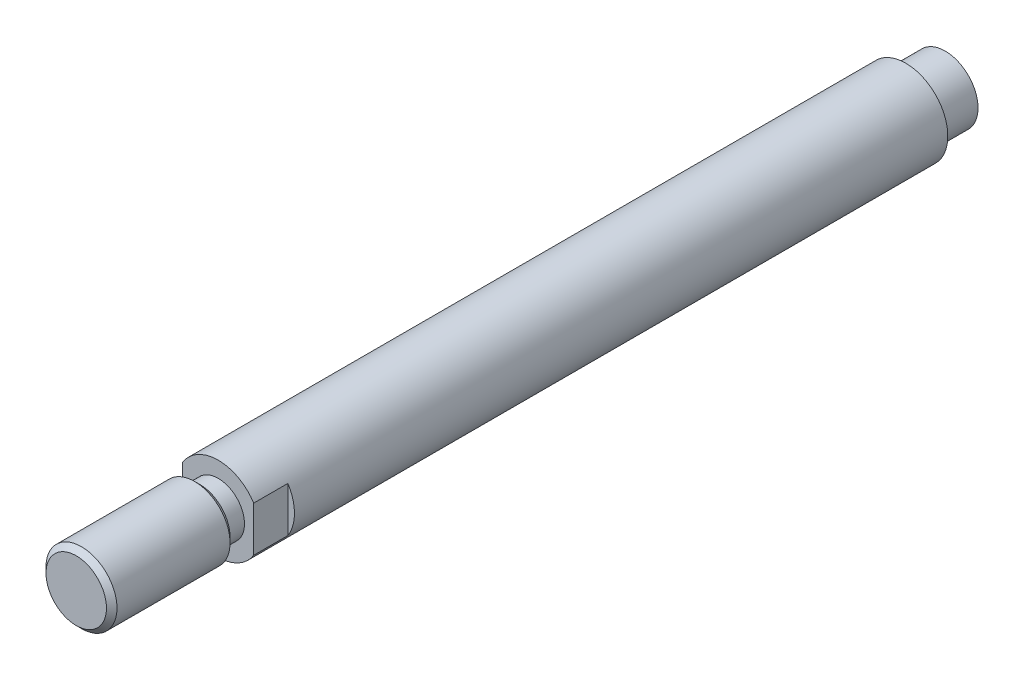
ISO-10303-21;
HEADER;
FILE_DESCRIPTION(('STEP AP214'),'2;1');
FILE_NAME('part.step','',(''),(''),'','','');
FILE_SCHEMA(('AUTOMOTIVE_DESIGN { 1 0 10303 214 1 1 1 1 }'));
ENDSEC;
DATA;
#1=APPLICATION_CONTEXT('core data for automotive mechanical design processes');
#2=APPLICATION_PROTOCOL_DEFINITION('international standard','automotive_design',2000,#1);
#3=PRODUCT_CONTEXT('',#1,'mechanical');
#4=PRODUCT('Part','Part','',(#3));
#5=PRODUCT_RELATED_PRODUCT_CATEGORY('part','',(#4));
#6=PRODUCT_DEFINITION_FORMATION('','',#4);
#7=PRODUCT_DEFINITION_CONTEXT('part definition',#1,'design');
#8=PRODUCT_DEFINITION('design','',#6,#7);
#9=PRODUCT_DEFINITION_SHAPE('','',#8);
#10=(LENGTH_UNIT() NAMED_UNIT(*) SI_UNIT(.MILLI.,.METRE.));
#11=(NAMED_UNIT(*) PLANE_ANGLE_UNIT() SI_UNIT($,.RADIAN.));
#12=(NAMED_UNIT(*) SI_UNIT($,.STERADIAN.) SOLID_ANGLE_UNIT());
#13=UNCERTAINTY_MEASURE_WITH_UNIT(LENGTH_MEASURE(1.E-05),#10,'distance_accuracy_value','');
#14=(GEOMETRIC_REPRESENTATION_CONTEXT(3) GLOBAL_UNCERTAINTY_ASSIGNED_CONTEXT((#13)) GLOBAL_UNIT_ASSIGNED_CONTEXT((#10,
#11,#12)) REPRESENTATION_CONTEXT('',''));
#15=CARTESIAN_POINT('',(0.,0.,0.));
#16=DIRECTION('',(0.,0.,1.));
#17=DIRECTION('',(1.,0.,0.));
#18=AXIS2_PLACEMENT_3D('',#15,#16,#17);
#19=CARTESIAN_POINT('',(0.,0.,0.));
#20=DIRECTION('',(0.,0.,-1.));
#21=DIRECTION('',(-1.,0.,0.));
#22=AXIS2_PLACEMENT_3D('',#19,#20,#21);
#23=PLANE('',#22);
#24=CARTESIAN_POINT('',(0.,0.,0.));
#25=DIRECTION('',(0.,0.,-1.));
#26=DIRECTION('',(-1.,0.,0.));
#27=AXIS2_PLACEMENT_3D('',#24,#25,#26);
#28=CIRCLE('',#27,12.5);
#29=CARTESIAN_POINT('',(-12.5,0.,0.));
#30=VERTEX_POINT('',#29);
#31=EDGE_CURVE('E409',#30,#30,#28,.T.);
#32=ORIENTED_EDGE('',*,*,#31,.T.);
#33=EDGE_LOOP('',(#32));
#34=FACE_BOUND('',#33,.T.);
#35=ADVANCED_FACE('F348',(#34),#23,.T.);
#36=CARTESIAN_POINT('',(0.,0.,330.5));
#37=DIRECTION('',(0.,0.,1.));
#38=DIRECTION('',(1.,0.,0.));
#39=AXIS2_PLACEMENT_3D('',#36,#37,#38);
#40=PLANE('',#39);
#41=CARTESIAN_POINT('',(0.,0.,330.5));
#42=DIRECTION('',(0.,0.,1.));
#43=DIRECTION('',(1.,0.,0.));
#44=AXIS2_PLACEMENT_3D('',#41,#42,#43);
#45=CIRCLE('',#44,11.5);
#46=CARTESIAN_POINT('',(11.5,0.,330.5));
#47=VERTEX_POINT('',#46);
#48=EDGE_CURVE('E437',#47,#47,#45,.T.);
#49=ORIENTED_EDGE('',*,*,#48,.T.);
#50=EDGE_LOOP('',(#49));
#51=FACE_BOUND('',#50,.T.);
#52=ADVANCED_FACE('F463',(#51),#40,.T.);
#53=CARTESIAN_POINT('',(0.,0.,-6.24300366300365));
#54=DIRECTION('',(0.,0.,-1.));
#55=DIRECTION('',(-1.,0.,0.));
#56=AXIS2_PLACEMENT_3D('',#53,#54,#55);
#57=CYLINDRICAL_SURFACE('',#56,13.5);
#58=CARTESIAN_POINT('',(0.,0.,285.5));
#59=DIRECTION('',(0.,0.,-1.));
#60=DIRECTION('',(-1.,0.,0.));
#61=AXIS2_PLACEMENT_3D('',#58,#59,#60);
#62=CIRCLE('',#61,13.5);
#63=CARTESIAN_POINT('',(-13.5,0.,285.5));
#64=VERTEX_POINT('',#63);
#65=EDGE_CURVE('E434',#64,#64,#62,.F.);
#66=ORIENTED_EDGE('',*,*,#65,.T.);
#67=EDGE_LOOP('',(#66));
#68=FACE_BOUND('',#67,.T.);
#69=CARTESIAN_POINT('',(0.,0.,328.5));
#70=DIRECTION('',(0.,0.,1.));
#71=DIRECTION('',(1.,0.,0.));
#72=AXIS2_PLACEMENT_3D('',#69,#70,#71);
#73=CIRCLE('',#72,13.5);
#74=CARTESIAN_POINT('',(13.5,0.,328.5));
#75=VERTEX_POINT('',#74);
#76=EDGE_CURVE('E431',#75,#75,#73,.F.);
#77=ORIENTED_EDGE('',*,*,#76,.T.);
#78=EDGE_LOOP('',(#77));
#79=FACE_BOUND('',#78,.T.);
#80=ADVANCED_FACE('F468',(#68,#79),#57,.T.);
#81=CARTESIAN_POINT('',(0.,9.99999999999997,283.5));
#82=DIRECTION('',(0.,0.,-1.));
#83=DIRECTION('',(-1.,0.,0.));
#84=AXIS2_PLACEMENT_3D('',#81,#82,#83);
#85=PLANE('',#84);
#86=CARTESIAN_POINT('',(0.,0.,283.5));
#87=DIRECTION('',(0.,0.,-1.));
#88=DIRECTION('',(-1.,0.,0.));
#89=AXIS2_PLACEMENT_3D('',#86,#87,#88);
#90=CIRCLE('',#89,11.5000000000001);
#91=CARTESIAN_POINT('',(-11.5000000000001,0.,283.5));
#92=VERTEX_POINT('',#91);
#93=EDGE_CURVE('E428',#92,#92,#90,.T.);
#94=ORIENTED_EDGE('',*,*,#93,.T.);
#95=EDGE_LOOP('',(#94));
#96=FACE_BOUND('',#95,.T.);
#97=CARTESIAN_POINT('',(0.,0.,283.5));
#98=DIRECTION('',(0.,0.,-1.));
#99=DIRECTION('',(-1.,0.,0.));
#100=AXIS2_PLACEMENT_3D('',#97,#98,#99);
#101=CIRCLE('',#100,9.99999999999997);
#102=CARTESIAN_POINT('',(-9.99999999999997,0.,283.5));
#103=VERTEX_POINT('',#102);
#104=EDGE_CURVE('E425',#103,#103,#101,.T.);
#105=ORIENTED_EDGE('',*,*,#104,.F.);
#106=EDGE_LOOP('',(#105));
#107=FACE_BOUND('',#106,.T.);
#108=ADVANCED_FACE('F494',(#96,#107),#85,.T.);
#109=CARTESIAN_POINT('',(0.,0.,-6.24300366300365));
#110=DIRECTION('',(0.,0.,-1.));
#111=DIRECTION('',(-1.,0.,0.));
#112=AXIS2_PLACEMENT_3D('',#109,#110,#111);
#113=CYLINDRICAL_SURFACE('',#112,9.99999999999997);
#114=ORIENTED_EDGE('',*,*,#104,.T.);
#115=EDGE_LOOP('',(#114));
#116=FACE_BOUND('',#115,.T.);
#117=CARTESIAN_POINT('',(0.,0.,276.5));
#118=DIRECTION('',(0.,0.,-1.));
#119=DIRECTION('',(-1.,0.,0.));
#120=AXIS2_PLACEMENT_3D('',#117,#118,#119);
#121=CIRCLE('',#120,9.99999999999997);
#122=CARTESIAN_POINT('',(-9.99999999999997,0.,276.5));
#123=VERTEX_POINT('',#122);
#124=EDGE_CURVE('E422',#123,#123,#121,.T.);
#125=ORIENTED_EDGE('',*,*,#124,.F.);
#126=EDGE_LOOP('',(#125));
#127=FACE_BOUND('',#126,.T.);
#128=ADVANCED_FACE('F491',(#116,#127),#113,.T.);
#129=CARTESIAN_POINT('',(0.,16.,276.5));
#130=DIRECTION('',(0.,0.,1.));
#131=DIRECTION('',(1.,0.,0.));
#132=AXIS2_PLACEMENT_3D('',#129,#130,#131);
#133=PLANE('',#132);
#134=DIRECTION('',(0.,1.,0.));
#135=VECTOR('',#134,1.);
#136=CARTESIAN_POINT('',(13.5,-16.,276.5));
#137=LINE('',#136,#135);
#138=CARTESIAN_POINT('',(13.5,-8.58778201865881,276.5));
#139=VERTEX_POINT('',#138);
#140=CARTESIAN_POINT('',(13.5,8.5877820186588,276.5));
#141=VERTEX_POINT('',#140);
#142=EDGE_CURVE('E402',#139,#141,#137,.T.);
#143=ORIENTED_EDGE('',*,*,#142,.T.);
#144=CARTESIAN_POINT('',(0.,0.,276.5));
#145=DIRECTION('',(0.,0.,-1.));
#146=DIRECTION('',(-1.,0.,0.));
#147=AXIS2_PLACEMENT_3D('',#144,#145,#146);
#148=CIRCLE('',#147,16.);
#149=CARTESIAN_POINT('',(-13.5,8.58778201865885,276.5));
#150=VERTEX_POINT('',#149);
#151=EDGE_CURVE('E420',#150,#141,#148,.T.);
#152=ORIENTED_EDGE('',*,*,#151,.F.);
#153=DIRECTION('',(0.,1.,0.));
#154=VECTOR('',#153,1.);
#155=CARTESIAN_POINT('',(-13.5,-16.,276.5));
#156=LINE('',#155,#154);
#157=CARTESIAN_POINT('',(-13.5,-8.58778201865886,276.5));
#158=VERTEX_POINT('',#157);
#159=EDGE_CURVE('E362',#158,#150,#156,.T.);
#160=ORIENTED_EDGE('',*,*,#159,.F.);
#161=EDGE_CURVE('E419',#139,#158,#148,.T.);
#162=ORIENTED_EDGE('',*,*,#161,.F.);
#163=EDGE_LOOP('',(#143,#152,#160,#162));
#164=FACE_BOUND('',#163,.T.);
#165=ORIENTED_EDGE('',*,*,#124,.T.);
#166=EDGE_LOOP('',(#165));
#167=FACE_BOUND('',#166,.T.);
#168=ADVANCED_FACE('F445',(#164,#167),#133,.T.);
#169=CARTESIAN_POINT('',(0.,0.,-6.24300366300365));
#170=DIRECTION('',(0.,0.,-1.));
#171=DIRECTION('',(-1.,0.,0.));
#172=AXIS2_PLACEMENT_3D('',#169,#170,#171);
#173=CYLINDRICAL_SURFACE('',#172,16.);
#174=DIRECTION('',(0.,0.,-1.));
#175=VECTOR('',#174,1.);
#176=CARTESIAN_POINT('',(13.5,-8.58778201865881,-6.24300366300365));
#177=LINE('',#176,#175);
#178=CARTESIAN_POINT('',(13.5,-8.58778201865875,263.5));
#179=VERTEX_POINT('',#178);
#180=EDGE_CURVE('E11',#139,#179,#177,.T.);
#181=ORIENTED_EDGE('',*,*,#180,.F.);
#182=ORIENTED_EDGE('',*,*,#161,.T.);
#183=DIRECTION('',(0.,0.,-1.));
#184=VECTOR('',#183,1.);
#185=CARTESIAN_POINT('',(-13.5,-8.5877820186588,-6.24300366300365));
#186=LINE('',#185,#184);
#187=CARTESIAN_POINT('',(-13.5,-8.5877820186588,263.5));
#188=VERTEX_POINT('',#187);
#189=EDGE_CURVE('E396',#188,#158,#186,.F.);
#190=ORIENTED_EDGE('',*,*,#189,.F.);
#191=CARTESIAN_POINT('',(0.,0.,263.5));
#192=DIRECTION('',(0.,0.,-1.));
#193=DIRECTION('',(-1.,0.,0.));
#194=AXIS2_PLACEMENT_3D('',#191,#192,#193);
#195=CIRCLE('',#194,16.);
#196=CARTESIAN_POINT('',(-13.5,8.5877820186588,263.5));
#197=VERTEX_POINT('',#196);
#198=EDGE_CURVE('E441',#197,#188,#195,.F.);
#199=ORIENTED_EDGE('',*,*,#198,.F.);
#200=DIRECTION('',(0.,0.,-1.));
#201=VECTOR('',#200,1.);
#202=CARTESIAN_POINT('',(-13.5,8.5877820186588,-6.24300366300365));
#203=LINE('',#202,#201);
#204=EDGE_CURVE('E366',#150,#197,#203,.T.);
#205=ORIENTED_EDGE('',*,*,#204,.F.);
#206=ORIENTED_EDGE('',*,*,#151,.T.);
#207=DIRECTION('',(0.,0.,-1.));
#208=VECTOR('',#207,1.);
#209=CARTESIAN_POINT('',(13.5,8.58778201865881,-6.24300366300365));
#210=LINE('',#209,#208);
#211=CARTESIAN_POINT('',(13.5,8.58778201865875,263.5));
#212=VERTEX_POINT('',#211);
#213=EDGE_CURVE('E355',#212,#141,#210,.F.);
#214=ORIENTED_EDGE('',*,*,#213,.F.);
#215=CARTESIAN_POINT('',(0.,0.,263.5));
#216=DIRECTION('',(0.,0.,-1.));
#217=DIRECTION('',(-1.,0.,0.));
#218=AXIS2_PLACEMENT_3D('',#215,#216,#217);
#219=CIRCLE('',#218,16.);
#220=EDGE_CURVE('E388',#179,#212,#219,.F.);
#221=ORIENTED_EDGE('',*,*,#220,.F.);
#222=EDGE_LOOP('',(#181,#182,#190,#199,#205,#206,#214,#221));
#223=FACE_BOUND('',#222,.T.);
#224=CARTESIAN_POINT('',(0.,0.,15.));
#225=DIRECTION('',(0.,0.,-1.));
#226=DIRECTION('',(-1.,0.,0.));
#227=AXIS2_PLACEMENT_3D('',#224,#225,#226);
#228=CIRCLE('',#227,16.);
#229=CARTESIAN_POINT('',(-16.,0.,15.));
#230=VERTEX_POINT('',#229);
#231=EDGE_CURVE('E416',#230,#230,#228,.T.);
#232=ORIENTED_EDGE('',*,*,#231,.F.);
#233=EDGE_LOOP('',(#232));
#234=FACE_BOUND('',#233,.T.);
#235=ADVANCED_FACE('F389',(#223,#234),#173,.T.);
#236=CARTESIAN_POINT('',(0.,16.,15.));
#237=DIRECTION('',(0.,0.,-1.));
#238=DIRECTION('',(-1.,0.,0.));
#239=AXIS2_PLACEMENT_3D('',#236,#237,#238);
#240=PLANE('',#239);
#241=ORIENTED_EDGE('',*,*,#231,.T.);
#242=EDGE_LOOP('',(#241));
#243=FACE_BOUND('',#242,.T.);
#244=CARTESIAN_POINT('',(0.,0.,15.));
#245=DIRECTION('',(0.,0.,-1.));
#246=DIRECTION('',(-1.,0.,0.));
#247=AXIS2_PLACEMENT_3D('',#244,#245,#246);
#248=CIRCLE('',#247,12.5);
#249=CARTESIAN_POINT('',(-12.5,0.,15.));
#250=VERTEX_POINT('',#249);
#251=EDGE_CURVE('E413',#250,#250,#248,.T.);
#252=ORIENTED_EDGE('',*,*,#251,.F.);
#253=EDGE_LOOP('',(#252));
#254=FACE_BOUND('',#253,.T.);
#255=ADVANCED_FACE('F475',(#243,#254),#240,.T.);
#256=CARTESIAN_POINT('',(0.,0.,-6.24300366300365));
#257=DIRECTION('',(0.,0.,-1.));
#258=DIRECTION('',(-1.,0.,0.));
#259=AXIS2_PLACEMENT_3D('',#256,#257,#258);
#260=CYLINDRICAL_SURFACE('',#259,12.5);
#261=ORIENTED_EDGE('',*,*,#251,.T.);
#262=EDGE_LOOP('',(#261));
#263=FACE_BOUND('',#262,.T.);
#264=ORIENTED_EDGE('',*,*,#31,.F.);
#265=EDGE_LOOP('',(#264));
#266=FACE_BOUND('',#265,.T.);
#267=ADVANCED_FACE('F472',(#263,#266),#260,.T.);
#268=CARTESIAN_POINT('',(0.,0.,283.5));
#269=DIRECTION('',(0.,0.,1.));
#270=DIRECTION('',(1.,0.,0.));
#271=AXIS2_PLACEMENT_3D('',#268,#269,#270);
#272=CONICAL_SURFACE('',#271,11.5,0.785398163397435);
#273=ORIENTED_EDGE('',*,*,#65,.F.);
#274=EDGE_LOOP('',(#273));
#275=FACE_BOUND('',#274,.T.);
#276=ORIENTED_EDGE('',*,*,#93,.F.);
#277=EDGE_LOOP('',(#276));
#278=FACE_BOUND('',#277,.T.);
#279=ADVANCED_FACE('F474',(#275,#278),#272,.T.);
#280=CARTESIAN_POINT('',(0.,0.,328.5));
#281=DIRECTION('',(0.,0.,-1.));
#282=DIRECTION('',(-1.,0.,0.));
#283=AXIS2_PLACEMENT_3D('',#280,#281,#282);
#284=CONICAL_SURFACE('',#283,13.5,0.785398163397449);
#285=ORIENTED_EDGE('',*,*,#48,.F.);
#286=EDGE_LOOP('',(#285));
#287=FACE_BOUND('',#286,.T.);
#288=ORIENTED_EDGE('',*,*,#76,.F.);
#289=EDGE_LOOP('',(#288));
#290=FACE_BOUND('',#289,.T.);
#291=ADVANCED_FACE('F459',(#287,#290),#284,.T.);
#292=CARTESIAN_POINT('',(-16.,-16.,263.5));
#293=DIRECTION('',(0.,0.,-1.));
#294=DIRECTION('',(-1.,0.,0.));
#295=AXIS2_PLACEMENT_3D('',#292,#293,#294);
#296=PLANE('',#295);
#297=ORIENTED_EDGE('',*,*,#198,.T.);
#298=DIRECTION('',(0.,1.,0.));
#299=VECTOR('',#298,1.);
#300=CARTESIAN_POINT('',(-13.5,-16.,263.5));
#301=LINE('',#300,#299);
#302=EDGE_CURVE('E407',#188,#197,#301,.T.);
#303=ORIENTED_EDGE('',*,*,#302,.T.);
#304=EDGE_LOOP('',(#297,#303));
#305=FACE_BOUND('',#304,.T.);
#306=ADVANCED_FACE('F450',(#305),#296,.F.);
#307=CARTESIAN_POINT('',(-13.5,-16.,263.5));
#308=DIRECTION('',(1.,0.,0.));
#309=DIRECTION('',(0.,0.,-1.));
#310=AXIS2_PLACEMENT_3D('',#307,#308,#309);
#311=PLANE('',#310);
#312=ORIENTED_EDGE('',*,*,#189,.T.);
#313=ORIENTED_EDGE('',*,*,#159,.T.);
#314=ORIENTED_EDGE('',*,*,#204,.T.);
#315=ORIENTED_EDGE('',*,*,#302,.F.);
#316=EDGE_LOOP('',(#312,#313,#314,#315));
#317=FACE_BOUND('',#316,.T.);
#318=ADVANCED_FACE('F451',(#317),#311,.F.);
#319=CARTESIAN_POINT('',(13.5,-16.,263.5));
#320=DIRECTION('',(-1.,0.,0.));
#321=DIRECTION('',(0.,0.,1.));
#322=AXIS2_PLACEMENT_3D('',#319,#320,#321);
#323=PLANE('',#322);
#324=ORIENTED_EDGE('',*,*,#213,.T.);
#325=ORIENTED_EDGE('',*,*,#142,.F.);
#326=ORIENTED_EDGE('',*,*,#180,.T.);
#327=DIRECTION('',(0.,1.,0.));
#328=VECTOR('',#327,1.);
#329=CARTESIAN_POINT('',(13.5,-16.,263.5));
#330=LINE('',#329,#328);
#331=EDGE_CURVE('E400',#179,#212,#330,.T.);
#332=ORIENTED_EDGE('',*,*,#331,.T.);
#333=EDGE_LOOP('',(#324,#325,#326,#332));
#334=FACE_BOUND('',#333,.T.);
#335=ADVANCED_FACE('F399',(#334),#323,.F.);
#336=CARTESIAN_POINT('',(13.5,-16.,263.5));
#337=DIRECTION('',(0.,0.,-1.));
#338=DIRECTION('',(-1.,0.,0.));
#339=AXIS2_PLACEMENT_3D('',#336,#337,#338);
#340=PLANE('',#339);
#341=ORIENTED_EDGE('',*,*,#331,.F.);
#342=ORIENTED_EDGE('',*,*,#220,.T.);
#343=EDGE_LOOP('',(#341,#342));
#344=FACE_BOUND('',#343,.T.);
#345=ADVANCED_FACE('F403',(#344),#340,.F.);
#346=CLOSED_SHELL('',(#35,#52,#80,#108,#128,#168,#235,#255,#267,#279,#291,#306,#318,#335,#345));
#347=MANIFOLD_SOLID_BREP('B2',#346);
#348=ADVANCED_BREP_SHAPE_REPRESENTATION('',(#18,#347),#14);
#349=SHAPE_DEFINITION_REPRESENTATION(#9,#348);
ENDSEC;
END-ISO-10303-21;
